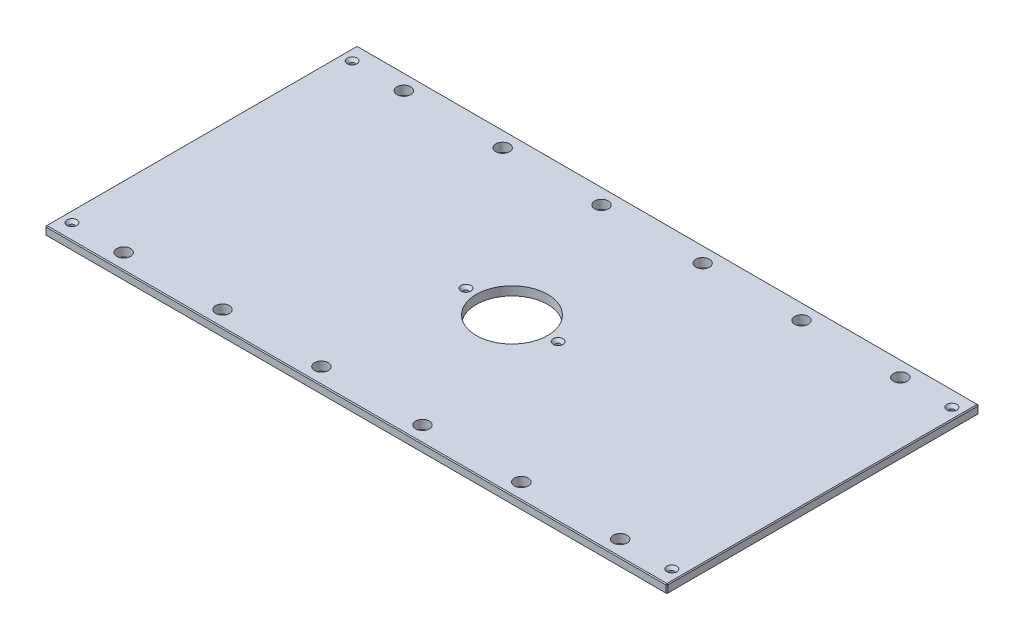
from build123d import *

# Parameters (mm, degrees)
SKETCH1_W                                        = 898.525
SKETCH1_H                                        = 450.85
BOSS_EXTRUDE1_DEPTH                              = 12.7
SKETCH13_R                                       = 51.562
CUT_EXTRUDE6_DEPTH                               = 503.806637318
F_25_32_0_78125_DIAMETER_HOLE1_D                 = 19.84375
CHAMFER2_SIZE                                    = 1.27
CSK_FOR_1_4_FLAT_HEAD_MACHINE_SCREW1_D           = 6.7564
CSK_FOR_1_4_FLAT_HEAD_MACHINE_SCREW1_CSINK_D     = 14.2748
CSK_FOR_1_4_FLAT_HEAD_MACHINE_SCREW1_CSINK_ANGLE = 82


with BuildPart() as part:
    # Sketch1 → Boss-Extrude1 (new body)
    with BuildSketch(Plane(origin=(0, 0, 0), x_dir=(1, 0, 0), z_dir=(0, 1, 0))):
        Rectangle(SKETCH1_W, SKETCH1_H)
    extrude(amount=BOSS_EXTRUDE1_DEPTH)

    # Sketch13 → Cut-Extrude6 (cut, through all)
    with BuildSketch(Plane(origin=(0, 12.7, 0), x_dir=(1, 0, 0), z_dir=(0, 1, 0))):
        with Locations(Location((0, 0, 0), (0, 0, 270))):
            Circle(SKETCH13_R)
    extrude(amount=-CUT_EXTRUDE6_DEPTH, mode=Mode.SUBTRACT)

    # 25_32 _0.78125_ Diameter Hole1 (through all)
    with Locations(Plane(origin=(0, 12.7, 0), x_dir=(1, 0, 0), z_dir=(0, 1, 0))):
        with Locations((358.775, 202.40498), (-358.775, 202.40498), (358.775, -202.40498), (-358.775, -202.40498), (-215.9, 202.40498), (215.9, 202.40498), (215.9, -202.40498), (-215.9, -202.40498), (73.025, 202.40498), (-73.025, 202.40498), (-73.025, -202.40498), (73.025, -202.40498)):
            Hole(F_25_32_0_78125_DIAMETER_HOLE1_D / 2)

    # Chamfer2
    chamfer2_edges = [part.edges().sort_by_distance(p)[0] for p in [
        (449.2625, 12.7, 0),
        (0, 12.7, -225.425),
        (-449.2625, 12.7, 0),
        (0, 0, -225.425),
        (449.2625, 0, 0),
        (0, 0, 225.425),
        (-449.2625, 0, 0),
        (0, 12.7, 225.425),
        (-449.2625, 6.35, -225.425),
        (449.2625, 6.35, -225.425),
        (449.2625, 6.35, 225.425),
        (-449.2625, 6.35, 225.425),
    ]]
    chamfer(chamfer2_edges, length=CHAMFER2_SIZE)

    # CSK for 1_4 Flat Head Machine Screw1 (through all)
    with Locations(Plane(origin=(0, 12.7, 0), x_dir=(1, 0, 0), z_dir=(0, 1, 0))):
        with Locations((433.3875, 202.40498), (433.3875, -202.40498), (-433.3875, -202.40498), (-66.675, 0), (66.675, 0), (-433.3875, 202.40498), (-358.775, 202.40498), (-358.775, -202.40498)):
            CounterSinkHole(CSK_FOR_1_4_FLAT_HEAD_MACHINE_SCREW1_D / 2, CSK_FOR_1_4_FLAT_HEAD_MACHINE_SCREW1_CSINK_D / 2, counter_sink_angle=CSK_FOR_1_4_FLAT_HEAD_MACHINE_SCREW1_CSINK_ANGLE)


solid = part.part
